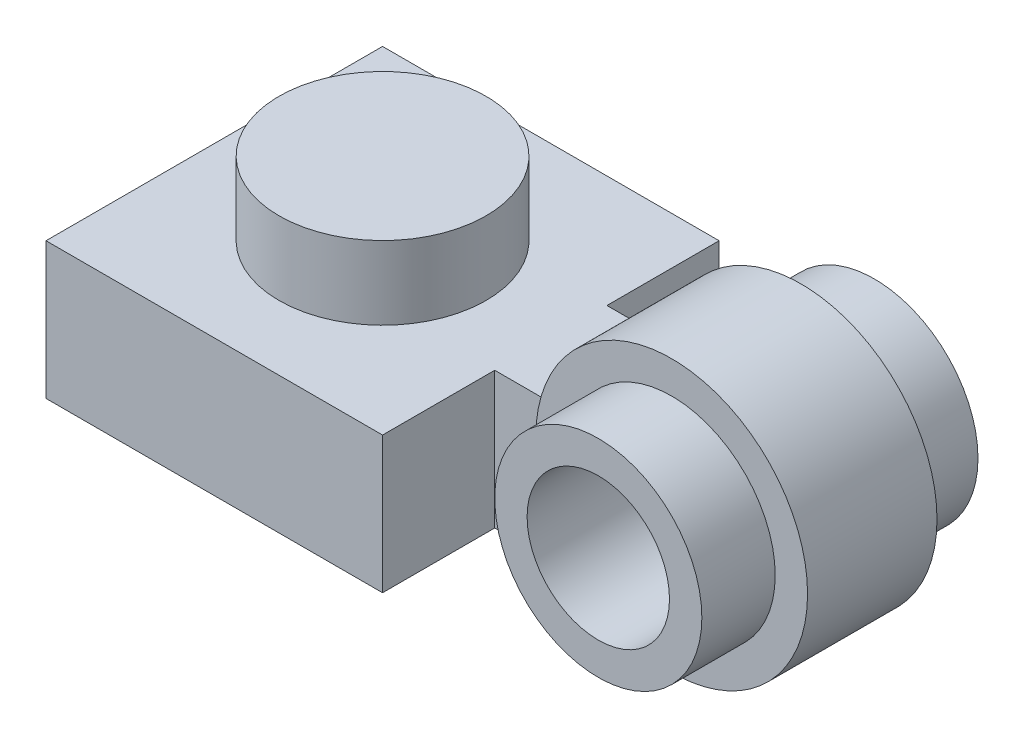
from build123d import *

# Parameters (mm, degrees)
SKETCH1_W           = 7.8
SKETCH1_H           = 7.8
EXTRUDE1_DEPTH      = 3.166
SKETCH2_R           = 2.4
EXTRUDE2_DEPTH      = 1.7
SKETCH3_W           = 4.9
SKETCH3_H           = 4.9
EXTRUDE3_DEPTH      = 2.5
SKETCH5_W           = 2.6
SKETCH5_H           = 3.166
BOSS_EXTRUDE2_DEPTH = 6.8
FILLET2_R           = 1
SKETCH7_R           = 3.15
BOSS_EXTRUDE5_DEPTH = 1.5
SKETCH10_R          = 2.4
BOSS_EXTRUDE6_DEPTH = 1.7
BOSS_EXTRUDE7_START = 1.7
SKETCH11_R          = 2.4
BOSS_EXTRUDE7_DEPTH = 1.7
SKETCH12_R          = 1.65
CUT_EXTRUDE2_DEPTH  = 15.531173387


with BuildPart() as part:
    # Sketch1 → Extrude1 (new body)
    with BuildSketch(Plane(origin=(0, 0, 0), x_dir=(1, 0, 0), z_dir=(0, 1, 0))):
        Rectangle(SKETCH1_W, SKETCH1_H)
    extrude(amount=EXTRUDE1_DEPTH)

    # Sketch2 → Extrude2 (add)
    with BuildSketch(Plane(origin=(0, 3.166, 0), x_dir=(1, 0, 0), z_dir=(0, 1, 0))):
        with Locations(Location((0, 0, 0), (0, 0, 270))):
            Circle(SKETCH2_R)
    extrude(amount=EXTRUDE2_DEPTH)

    # Sketch3 → Extrude3 (cut)
    with BuildSketch(Plane.XZ):
        Rectangle(SKETCH3_W, SKETCH3_H)
    extrude(amount=-EXTRUDE3_DEPTH, mode=Mode.SUBTRACT)

    # Sketch5 → Boss-Extrude2 (add)
    with BuildSketch(Plane(origin=(3.9, 0, 0), x_dir=(0, 0, -1), z_dir=(1, 0, 0))):
        with Locations((0, 1.583)):
            Rectangle(SKETCH5_W, SKETCH5_H)
    extrude(amount=BOSS_EXTRUDE2_DEPTH)

    # Fillet2
    fillet2_edges = [part.edges().sort_by_distance(p)[0] for p in [
        (10.7, 3.166, 0),
        (10.7, 0, 0),
    ]]
    fillet(fillet2_edges, radius=FILLET2_R)

    # Sketch7 → Boss-Extrude5 (add, symmetric)
    with BuildSketch(Plane.XY):
        with Locations((8.2, 2.5)):
            Circle(SKETCH7_R)
    extrude(amount=BOSS_EXTRUDE5_DEPTH, both=True)

    # Sketch10 → Boss-Extrude6 (add)
    with BuildSketch(Plane.XY.offset(1.5)):
        with Locations((8.2, 2.5)):
            Circle(SKETCH10_R)
    extrude(amount=BOSS_EXTRUDE6_DEPTH)

    # Sketch11 → Boss-Extrude7 (add)
    with BuildSketch(Plane(origin=(0, 0, -1.5), x_dir=(-1, 0, 0), z_dir=(0, 0, -1)).offset(BOSS_EXTRUDE7_START)):
        with Locations(Location((-8.2, 2.5, 0), (0, 0, 180))):
            Circle(SKETCH11_R)
    extrude(amount=-BOSS_EXTRUDE7_DEPTH)

    # Sketch12 → Cut-Extrude2 (cut, through all)
    with BuildSketch(Plane(origin=(0, 0, -3.2), x_dir=(-1, 0, 0), z_dir=(0, 0, -1))):
        with Locations((-8.2, 2.5)):
            Circle(SKETCH12_R)
    extrude(amount=-CUT_EXTRUDE2_DEPTH, mode=Mode.SUBTRACT)


solid = part.part
